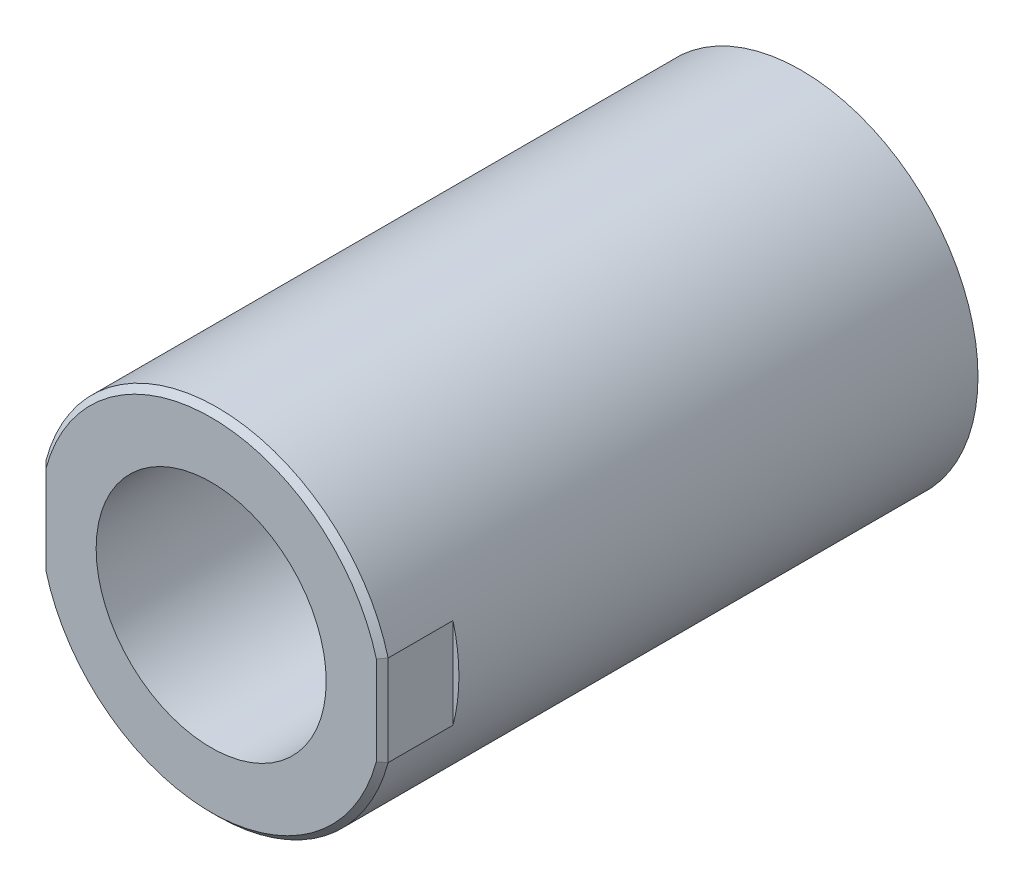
ISO-10303-21;
HEADER;
FILE_DESCRIPTION(('STEP AP214'),'2;1');
FILE_NAME('part.step','',(''),(''),'','','');
FILE_SCHEMA(('AUTOMOTIVE_DESIGN { 1 0 10303 214 1 1 1 1 }'));
ENDSEC;
DATA;
#1=APPLICATION_CONTEXT('core data for automotive mechanical design processes');
#2=APPLICATION_PROTOCOL_DEFINITION('international standard','automotive_design',2000,#1);
#3=PRODUCT_CONTEXT('',#1,'mechanical');
#4=PRODUCT('Part','Part','',(#3));
#5=PRODUCT_RELATED_PRODUCT_CATEGORY('part','',(#4));
#6=PRODUCT_DEFINITION_FORMATION('','',#4);
#7=PRODUCT_DEFINITION_CONTEXT('part definition',#1,'design');
#8=PRODUCT_DEFINITION('design','',#6,#7);
#9=PRODUCT_DEFINITION_SHAPE('','',#8);
#10=(LENGTH_UNIT() NAMED_UNIT(*) SI_UNIT(.MILLI.,.METRE.));
#11=(NAMED_UNIT(*) PLANE_ANGLE_UNIT() SI_UNIT($,.RADIAN.));
#12=(NAMED_UNIT(*) SI_UNIT($,.STERADIAN.) SOLID_ANGLE_UNIT());
#13=UNCERTAINTY_MEASURE_WITH_UNIT(LENGTH_MEASURE(1.E-05),#10,'distance_accuracy_value','');
#14=(GEOMETRIC_REPRESENTATION_CONTEXT(3) GLOBAL_UNCERTAINTY_ASSIGNED_CONTEXT((#13)) GLOBAL_UNIT_ASSIGNED_CONTEXT((#10,
#11,#12)) REPRESENTATION_CONTEXT('',''));
#15=CARTESIAN_POINT('',(0.,0.,0.));
#16=DIRECTION('',(0.,0.,1.));
#17=DIRECTION('',(1.,0.,0.));
#18=AXIS2_PLACEMENT_3D('',#15,#16,#17);
#19=CARTESIAN_POINT('',(0.,0.,-100.));
#20=DIRECTION('',(0.,0.,1.));
#21=DIRECTION('',(1.,0.,0.));
#22=AXIS2_PLACEMENT_3D('',#19,#20,#21);
#23=PLANE('',#22);
#24=CARTESIAN_POINT('',(0.,0.,-100.));
#25=DIRECTION('',(0.,0.,1.));
#26=DIRECTION('',(1.,0.,0.));
#27=AXIS2_PLACEMENT_3D('',#24,#25,#26);
#28=CIRCLE('',#27,30.);
#29=CARTESIAN_POINT('',(30.,0.,-100.));
#30=VERTEX_POINT('',#29);
#31=EDGE_CURVE('E205',#30,#30,#28,.T.);
#32=ORIENTED_EDGE('',*,*,#31,.F.);
#33=EDGE_LOOP('',(#32));
#34=FACE_BOUND('',#33,.T.);
#35=ADVANCED_FACE('F37',(#34),#23,.F.);
#36=CARTESIAN_POINT('',(29.,-10.5,-12.));
#37=DIRECTION('',(0.,0.,-1.));
#38=DIRECTION('',(-1.,0.,0.));
#39=AXIS2_PLACEMENT_3D('',#36,#37,#38);
#40=PLANE('',#39);
#41=CARTESIAN_POINT('',(0.,0.,-12.));
#42=DIRECTION('',(0.,0.,-1.));
#43=DIRECTION('',(-1.,0.,0.));
#44=AXIS2_PLACEMENT_3D('',#41,#42,#43);
#45=CIRCLE('',#44,30.);
#46=CARTESIAN_POINT('',(29.,-7.6811457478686,-12.));
#47=VERTEX_POINT('',#46);
#48=CARTESIAN_POINT('',(29.,7.6811457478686,-12.));
#49=VERTEX_POINT('',#48);
#50=EDGE_CURVE('E208',#47,#49,#45,.F.);
#51=ORIENTED_EDGE('',*,*,#50,.T.);
#52=DIRECTION('',(0.,1.,0.));
#53=VECTOR('',#52,1.);
#54=CARTESIAN_POINT('',(29.,-10.5,-12.));
#55=LINE('',#54,#53);
#56=EDGE_CURVE('E108',#47,#49,#55,.T.);
#57=ORIENTED_EDGE('',*,*,#56,.F.);
#58=EDGE_LOOP('',(#51,#57));
#59=FACE_BOUND('',#58,.T.);
#60=ADVANCED_FACE('F165',(#59),#40,.F.);
#61=CARTESIAN_POINT('',(-31.5,-10.5,-12.));
#62=DIRECTION('',(0.,0.,-1.));
#63=DIRECTION('',(-1.,0.,0.));
#64=AXIS2_PLACEMENT_3D('',#61,#62,#63);
#65=PLANE('',#64);
#66=CARTESIAN_POINT('',(0.,0.,-12.));
#67=DIRECTION('',(0.,0.,-1.));
#68=DIRECTION('',(-1.,0.,0.));
#69=AXIS2_PLACEMENT_3D('',#66,#67,#68);
#70=CIRCLE('',#69,30.);
#71=CARTESIAN_POINT('',(-29.,7.6811457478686,-12.));
#72=VERTEX_POINT('',#71);
#73=CARTESIAN_POINT('',(-29.,-7.6811457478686,-12.));
#74=VERTEX_POINT('',#73);
#75=EDGE_CURVE('E104',#72,#74,#70,.F.);
#76=ORIENTED_EDGE('',*,*,#75,.T.);
#77=DIRECTION('',(0.,1.,0.));
#78=VECTOR('',#77,1.);
#79=CARTESIAN_POINT('',(-29.,-10.5,-12.));
#80=LINE('',#79,#78);
#81=EDGE_CURVE('E99',#74,#72,#80,.T.);
#82=ORIENTED_EDGE('',*,*,#81,.T.);
#83=EDGE_LOOP('',(#76,#82));
#84=FACE_BOUND('',#83,.T.);
#85=ADVANCED_FACE('F107',(#84),#65,.F.);
#86=CARTESIAN_POINT('',(0.,0.,-100.));
#87=DIRECTION('',(0.,0.,1.));
#88=DIRECTION('',(1.,0.,0.));
#89=AXIS2_PLACEMENT_3D('',#86,#87,#88);
#90=CYLINDRICAL_SURFACE('',#89,30.);
#91=DIRECTION('',(0.,0.,1.));
#92=VECTOR('',#91,1.);
#93=CARTESIAN_POINT('',(-29.,7.6811457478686,-100.));
#94=LINE('',#93,#92);
#95=CARTESIAN_POINT('',(-29.,7.6811457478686,-1.));
#96=VERTEX_POINT('',#95);
#97=EDGE_CURVE('E96',#96,#72,#94,.F.);
#98=ORIENTED_EDGE('',*,*,#97,.F.);
#99=CARTESIAN_POINT('',(0.,0.,-0.999999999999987));
#100=DIRECTION('',(0.,0.,1.));
#101=DIRECTION('',(1.,0.,0.));
#102=AXIS2_PLACEMENT_3D('',#99,#100,#101);
#103=CIRCLE('',#102,30.);
#104=CARTESIAN_POINT('',(29.,7.6811457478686,-1.));
#105=VERTEX_POINT('',#104);
#106=EDGE_CURVE('E50',#96,#105,#103,.F.);
#107=ORIENTED_EDGE('',*,*,#106,.T.);
#108=DIRECTION('',(0.,0.,1.));
#109=VECTOR('',#108,1.);
#110=CARTESIAN_POINT('',(29.,7.6811457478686,-100.));
#111=LINE('',#110,#109);
#112=EDGE_CURVE('E214',#49,#105,#111,.T.);
#113=ORIENTED_EDGE('',*,*,#112,.F.);
#114=ORIENTED_EDGE('',*,*,#50,.F.);
#115=DIRECTION('',(0.,0.,1.));
#116=VECTOR('',#115,1.);
#117=CARTESIAN_POINT('',(29.,-7.6811457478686,-100.));
#118=LINE('',#117,#116);
#119=CARTESIAN_POINT('',(29.,-7.6811457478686,-0.999999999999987));
#120=VERTEX_POINT('',#119);
#121=EDGE_CURVE('E115',#120,#47,#118,.F.);
#122=ORIENTED_EDGE('',*,*,#121,.F.);
#123=CARTESIAN_POINT('',(0.,0.,-0.999999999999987));
#124=DIRECTION('',(0.,0.,1.));
#125=DIRECTION('',(1.,0.,0.));
#126=AXIS2_PLACEMENT_3D('',#123,#124,#125);
#127=CIRCLE('',#126,30.);
#128=CARTESIAN_POINT('',(-29.,-7.6811457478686,-1.));
#129=VERTEX_POINT('',#128);
#130=EDGE_CURVE('E58',#120,#129,#127,.F.);
#131=ORIENTED_EDGE('',*,*,#130,.T.);
#132=DIRECTION('',(0.,0.,1.));
#133=VECTOR('',#132,1.);
#134=CARTESIAN_POINT('',(-29.,-7.6811457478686,-100.));
#135=LINE('',#134,#133);
#136=EDGE_CURVE('E113',#74,#129,#135,.T.);
#137=ORIENTED_EDGE('',*,*,#136,.F.);
#138=ORIENTED_EDGE('',*,*,#75,.F.);
#139=EDGE_LOOP('',(#98,#107,#113,#114,#122,#131,#137,#138));
#140=FACE_BOUND('',#139,.T.);
#141=ORIENTED_EDGE('',*,*,#31,.T.);
#142=EDGE_LOOP('',(#141));
#143=FACE_BOUND('',#142,.T.);
#144=ADVANCED_FACE('F111',(#140,#143),#90,.T.);
#145=CARTESIAN_POINT('',(29.,-10.5,0.));
#146=DIRECTION('',(-1.,0.,0.));
#147=DIRECTION('',(0.,0.,1.));
#148=AXIS2_PLACEMENT_3D('',#145,#146,#147);
#149=PLANE('',#148);
#150=ORIENTED_EDGE('',*,*,#112,.T.);
#151=DIRECTION('',(0.,-1.,0.));
#152=VECTOR('',#151,1.);
#153=CARTESIAN_POINT('',(29.,-7.6811457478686,-0.99999999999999));
#154=LINE('',#153,#152);
#155=EDGE_CURVE('E127',#105,#120,#154,.T.);
#156=ORIENTED_EDGE('',*,*,#155,.T.);
#157=ORIENTED_EDGE('',*,*,#121,.T.);
#158=ORIENTED_EDGE('',*,*,#56,.T.);
#159=EDGE_LOOP('',(#150,#156,#157,#158));
#160=FACE_BOUND('',#159,.T.);
#161=ADVANCED_FACE('F178',(#160),#149,.F.);
#162=CARTESIAN_POINT('',(-29.,-10.5,0.));
#163=DIRECTION('',(1.,0.,0.));
#164=DIRECTION('',(0.,0.,-1.));
#165=AXIS2_PLACEMENT_3D('',#162,#163,#164);
#166=PLANE('',#165);
#167=ORIENTED_EDGE('',*,*,#136,.T.);
#168=DIRECTION('',(0.,1.,0.));
#169=VECTOR('',#168,1.);
#170=CARTESIAN_POINT('',(-29.,7.6811457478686,-0.99999999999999));
#171=LINE('',#170,#169);
#172=EDGE_CURVE('E11',#129,#96,#171,.T.);
#173=ORIENTED_EDGE('',*,*,#172,.T.);
#174=ORIENTED_EDGE('',*,*,#97,.T.);
#175=ORIENTED_EDGE('',*,*,#81,.F.);
#176=EDGE_LOOP('',(#167,#173,#174,#175));
#177=FACE_BOUND('',#176,.T.);
#178=ADVANCED_FACE('F98',(#177),#166,.F.);
#179=CARTESIAN_POINT('',(0.,0.,0.));
#180=DIRECTION('',(0.,0.,1.));
#181=DIRECTION('',(1.,0.,0.));
#182=AXIS2_PLACEMENT_3D('',#179,#180,#181);
#183=PLANE('',#182);
#184=CARTESIAN_POINT('',(0.,0.,0.));
#185=DIRECTION('',(0.,0.,1.));
#186=DIRECTION('',(1.,0.,0.));
#187=AXIS2_PLACEMENT_3D('',#184,#185,#186);
#188=CIRCLE('',#187,29.);
#189=CARTESIAN_POINT('',(-28.,-7.54983443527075,0.));
#190=VERTEX_POINT('',#189);
#191=CARTESIAN_POINT('',(28.,-7.54983443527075,0.));
#192=VERTEX_POINT('',#191);
#193=EDGE_CURVE('E103',#190,#192,#188,.T.);
#194=ORIENTED_EDGE('',*,*,#193,.T.);
#195=DIRECTION('',(0.,1.,0.));
#196=VECTOR('',#195,1.);
#197=CARTESIAN_POINT('',(28.,7.6811457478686,0.));
#198=LINE('',#197,#196);
#199=CARTESIAN_POINT('',(28.,7.54983443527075,0.));
#200=VERTEX_POINT('',#199);
#201=EDGE_CURVE('E124',#192,#200,#198,.T.);
#202=ORIENTED_EDGE('',*,*,#201,.T.);
#203=CARTESIAN_POINT('',(0.,0.,0.));
#204=DIRECTION('',(0.,0.,1.));
#205=DIRECTION('',(1.,0.,0.));
#206=AXIS2_PLACEMENT_3D('',#203,#204,#205);
#207=CIRCLE('',#206,29.);
#208=CARTESIAN_POINT('',(-28.,7.54983443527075,0.));
#209=VERTEX_POINT('',#208);
#210=EDGE_CURVE('E122',#200,#209,#207,.T.);
#211=ORIENTED_EDGE('',*,*,#210,.T.);
#212=DIRECTION('',(0.,-1.,0.));
#213=VECTOR('',#212,1.);
#214=CARTESIAN_POINT('',(-28.,-7.6811457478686,0.));
#215=LINE('',#214,#213);
#216=EDGE_CURVE('E120',#209,#190,#215,.T.);
#217=ORIENTED_EDGE('',*,*,#216,.T.);
#218=EDGE_LOOP('',(#194,#202,#211,#217));
#219=FACE_BOUND('',#218,.T.);
#220=CARTESIAN_POINT('',(0.,0.,0.));
#221=DIRECTION('',(0.,0.,-1.));
#222=DIRECTION('',(-1.,0.,0.));
#223=AXIS2_PLACEMENT_3D('',#220,#221,#222);
#224=CIRCLE('',#223,19.5);
#225=CARTESIAN_POINT('',(-19.5,0.,0.));
#226=VERTEX_POINT('',#225);
#227=EDGE_CURVE('E109',#226,#226,#224,.F.);
#228=ORIENTED_EDGE('',*,*,#227,.F.);
#229=EDGE_LOOP('',(#228));
#230=FACE_BOUND('',#229,.T.);
#231=ADVANCED_FACE('F190',(#219,#230),#183,.T.);
#232=CARTESIAN_POINT('',(0.,0.,15.));
#233=DIRECTION('',(0.,0.,1.));
#234=DIRECTION('',(1.,0.,0.));
#235=AXIS2_PLACEMENT_3D('',#232,#233,#234);
#236=CYLINDRICAL_SURFACE('',#235,19.5);
#237=ORIENTED_EDGE('',*,*,#227,.T.);
#238=EDGE_LOOP('',(#237));
#239=FACE_BOUND('',#238,.T.);
#240=CARTESIAN_POINT('',(0.,0.,-36.));
#241=DIRECTION('',(0.,0.,1.));
#242=DIRECTION('',(1.,0.,0.));
#243=AXIS2_PLACEMENT_3D('',#240,#241,#242);
#244=CIRCLE('',#243,19.5);
#245=CARTESIAN_POINT('',(19.5,0.,-36.));
#246=VERTEX_POINT('',#245);
#247=EDGE_CURVE('E203',#246,#246,#244,.T.);
#248=ORIENTED_EDGE('',*,*,#247,.F.);
#249=EDGE_LOOP('',(#248));
#250=FACE_BOUND('',#249,.T.);
#251=ADVANCED_FACE('F175',(#239,#250),#236,.F.);
#252=CARTESIAN_POINT('',(0.,0.,-36.));
#253=DIRECTION('',(0.,0.,1.));
#254=DIRECTION('',(1.,0.,0.));
#255=AXIS2_PLACEMENT_3D('',#252,#253,#254);
#256=CONICAL_SURFACE('',#255,19.5,1.02974425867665);
#257=CARTESIAN_POINT('',(0.,0.,-47.7167820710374));
#258=VERTEX_POINT('',#257);
#259=VERTEX_LOOP('',#258);
#260=FACE_BOUND('',#259,.T.);
#261=ORIENTED_EDGE('',*,*,#247,.T.);
#262=EDGE_LOOP('',(#261));
#263=FACE_BOUND('',#262,.T.);
#264=ADVANCED_FACE('F161',(#260,#263),#256,.F.);
#265=CARTESIAN_POINT('',(-29.,-10.5,-0.99999999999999));
#266=DIRECTION('',(-0.707106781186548,0.,0.707106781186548));
#267=DIRECTION('',(0.707106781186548,0.,0.707106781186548));
#268=AXIS2_PLACEMENT_3D('',#265,#266,#267);
#269=PLANE('',#268);
#270=CARTESIAN_POINT('',(-28.,7.54983443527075,0.));
#271=CARTESIAN_POINT('',(-28.1666543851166,7.5719067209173,-0.166654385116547));
#272=CARTESIAN_POINT('',(-28.3333149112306,7.59388547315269,-0.333314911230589));
#273=CARTESIAN_POINT('',(-28.666648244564,7.63765591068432,-0.666648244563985));
#274=CARTESIAN_POINT('',(-28.8333210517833,7.65944759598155,-0.833321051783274));
#275=CARTESIAN_POINT('',(-29.,7.68114574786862,-0.999999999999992));
#276=B_SPLINE_CURVE_WITH_KNOTS('',3,(#270,#271,#272,#273,#274,#275),.UNSPECIFIED.,.F.,.F.,(4,2,
4),(0.,0.710148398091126,1.42029679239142),.UNSPECIFIED.);
#277=EDGE_CURVE('E226',#96,#209,#276,.F.);
#278=ORIENTED_EDGE('',*,*,#277,.F.);
#279=ORIENTED_EDGE('',*,*,#172,.F.);
#280=CARTESIAN_POINT('',(-28.,-7.54983443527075,0.));
#281=CARTESIAN_POINT('',(-28.1666543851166,-7.5719067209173,-0.166654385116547));
#282=CARTESIAN_POINT('',(-28.3333149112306,-7.59388547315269,-0.333314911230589));
#283=CARTESIAN_POINT('',(-28.666648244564,-7.63765591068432,-0.666648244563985));
#284=CARTESIAN_POINT('',(-28.8333210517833,-7.65944759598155,-0.833321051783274));
#285=CARTESIAN_POINT('',(-29.,-7.68114574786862,-0.999999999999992));
#286=B_SPLINE_CURVE_WITH_KNOTS('',3,(#280,#281,#282,#283,#284,#285),.UNSPECIFIED.,.F.,.F.,(4,2,
4),(0.,0.710148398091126,1.42029679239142),.UNSPECIFIED.);
#287=EDGE_CURVE('E42',#190,#129,#286,.T.);
#288=ORIENTED_EDGE('',*,*,#287,.F.);
#289=ORIENTED_EDGE('',*,*,#216,.F.);
#290=EDGE_LOOP('',(#278,#279,#288,#289));
#291=FACE_BOUND('',#290,.T.);
#292=ADVANCED_FACE('F39',(#291),#269,.T.);
#293=CARTESIAN_POINT('',(0.,0.,0.));
#294=DIRECTION('',(0.,0.,-1.));
#295=DIRECTION('',(-1.,0.,0.));
#296=AXIS2_PLACEMENT_3D('',#293,#294,#295);
#297=CONICAL_SURFACE('',#296,29.,0.78539816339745);
#298=ORIENTED_EDGE('',*,*,#287,.T.);
#299=ORIENTED_EDGE('',*,*,#130,.F.);
#300=CARTESIAN_POINT('',(29.,-7.6811457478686,-0.999999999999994));
#301=CARTESIAN_POINT('',(28.8333210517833,-7.65944759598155,-0.833321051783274));
#302=CARTESIAN_POINT('',(28.666648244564,-7.63765591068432,-0.666648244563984));
#303=CARTESIAN_POINT('',(28.3333149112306,-7.5938854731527,-0.333314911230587));
#304=CARTESIAN_POINT('',(28.1666543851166,-7.57190672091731,-0.166654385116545));
#305=CARTESIAN_POINT('',(28.,-7.54983443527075,0.));
#306=B_SPLINE_CURVE_WITH_KNOTS('',3,(#300,#301,#302,#303,#304,#305),.UNSPECIFIED.,.F.,.F.,(4,2,
4),(0.,0.710148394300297,1.42029679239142),.UNSPECIFIED.);
#307=EDGE_CURVE('E139',#192,#120,#306,.F.);
#308=ORIENTED_EDGE('',*,*,#307,.F.);
#309=ORIENTED_EDGE('',*,*,#193,.F.);
#310=EDGE_LOOP('',(#298,#299,#308,#309));
#311=FACE_BOUND('',#310,.T.);
#312=ADVANCED_FACE('F150',(#311),#297,.T.);
#313=CARTESIAN_POINT('',(0.,0.,0.));
#314=DIRECTION('',(0.,0.,-1.));
#315=DIRECTION('',(-1.,0.,0.));
#316=AXIS2_PLACEMENT_3D('',#313,#314,#315);
#317=CONICAL_SURFACE('',#316,29.,0.78539816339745);
#318=ORIENTED_EDGE('',*,*,#277,.T.);
#319=ORIENTED_EDGE('',*,*,#210,.F.);
#320=CARTESIAN_POINT('',(28.,7.54983443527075,0.));
#321=CARTESIAN_POINT('',(28.1666543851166,7.5719067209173,-0.166654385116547));
#322=CARTESIAN_POINT('',(28.3333149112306,7.5938854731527,-0.333314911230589));
#323=CARTESIAN_POINT('',(28.666648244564,7.63765591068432,-0.666648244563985));
#324=CARTESIAN_POINT('',(28.8333210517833,7.65944759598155,-0.833321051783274));
#325=CARTESIAN_POINT('',(29.,7.68114574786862,-0.999999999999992));
#326=B_SPLINE_CURVE_WITH_KNOTS('',3,(#320,#321,#322,#323,#324,#325),.UNSPECIFIED.,.F.,.F.,(4,2,
4),(0.,0.710148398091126,1.42029679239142),.UNSPECIFIED.);
#327=EDGE_CURVE('E132',#105,#200,#326,.F.);
#328=ORIENTED_EDGE('',*,*,#327,.F.);
#329=ORIENTED_EDGE('',*,*,#106,.F.);
#330=EDGE_LOOP('',(#318,#319,#328,#329));
#331=FACE_BOUND('',#330,.T.);
#332=ADVANCED_FACE('F143',(#331),#317,.T.);
#333=CARTESIAN_POINT('',(28.,0.,0.));
#334=DIRECTION('',(0.707106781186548,0.,0.707106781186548));
#335=DIRECTION('',(0.707106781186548,0.,-0.707106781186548));
#336=AXIS2_PLACEMENT_3D('',#333,#334,#335);
#337=PLANE('',#336);
#338=ORIENTED_EDGE('',*,*,#307,.T.);
#339=ORIENTED_EDGE('',*,*,#155,.F.);
#340=ORIENTED_EDGE('',*,*,#327,.T.);
#341=ORIENTED_EDGE('',*,*,#201,.F.);
#342=EDGE_LOOP('',(#338,#339,#340,#341));
#343=FACE_BOUND('',#342,.T.);
#344=ADVANCED_FACE('F146',(#343),#337,.T.);
#345=CLOSED_SHELL('',(#35,#60,#85,#144,#161,#178,#231,#251,#264,#292,#312,#332,#344));
#346=MANIFOLD_SOLID_BREP('B2',#345);
#347=ADVANCED_BREP_SHAPE_REPRESENTATION('',(#18,#346),#14);
#348=SHAPE_DEFINITION_REPRESENTATION(#9,#347);
ENDSEC;
END-ISO-10303-21;
